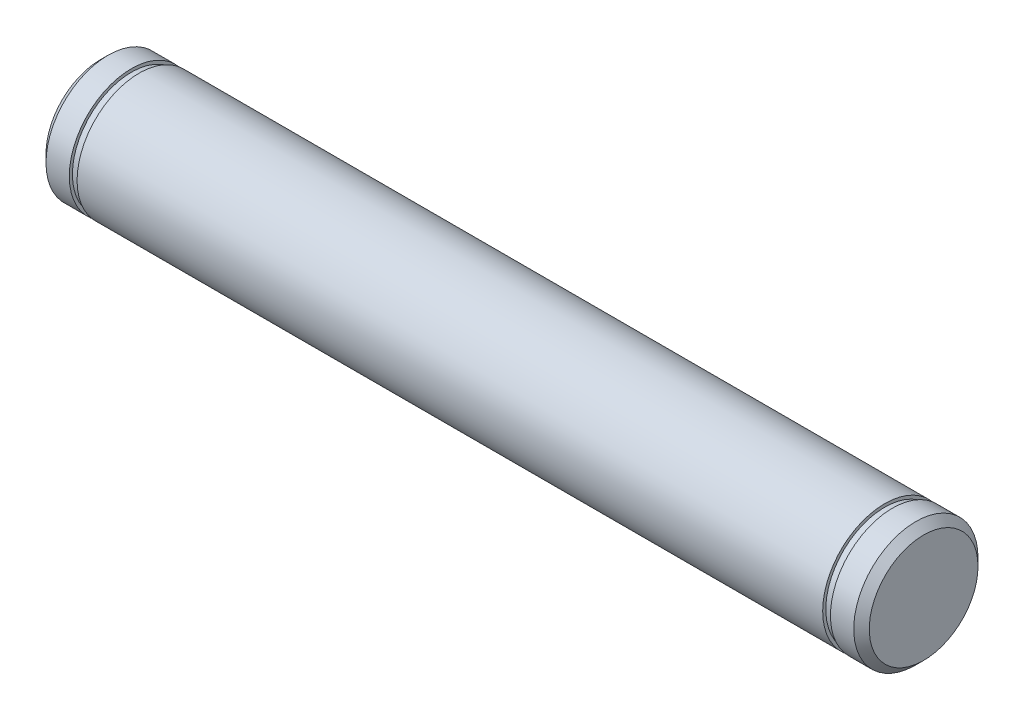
from build123d import *

# Parameters (mm, degrees)
SKETCH1_R           = 2
BOSS_EXTRUDE1_DEPTH = 26.5
CUT_EXTRUDE2_START  = -1
SKETCH2_R           = 2.498108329
SKETCH2_R_2         = 1.9
CUT_EXTRUDE2_DEPTH  = 0.25
CUT_EXTRUDE3_START  = -1.25
SKETCH3_R           = 2.5
SKETCH3_R_2         = 1.9
CUT_EXTRUDE3_DEPTH  = 0.25
CHAMFER1_SIZE       = 0.25


with BuildPart() as part:
    # Sketch1 → Boss-Extrude1 (new body)
    with BuildSketch(Plane(origin=(0, 0, 0), x_dir=(0, 0, -1), z_dir=(1, 0, 0))):
        Circle(SKETCH1_R)
    extrude(amount=BOSS_EXTRUDE1_DEPTH)

    # Sketch2 → Cut-Extrude2 (cut)
    with BuildSketch(Plane(origin=(26.5, 0, 0), x_dir=(0, 0, -1), z_dir=(1, 0, 0)).offset(CUT_EXTRUDE2_START)):
        Circle(SKETCH2_R)
        Circle(SKETCH2_R_2, mode=Mode.SUBTRACT)
    extrude(amount=-CUT_EXTRUDE2_DEPTH, mode=Mode.SUBTRACT)

    # Sketch3 → Cut-Extrude3 (cut)
    with BuildSketch(Plane.ZY.offset(CUT_EXTRUDE3_START)):
        Circle(SKETCH3_R)
        with Locations(Location((0, 0, 0), (0, 0, 180))):
            Circle(SKETCH3_R_2, mode=Mode.SUBTRACT)
    extrude(amount=CUT_EXTRUDE3_DEPTH, mode=Mode.SUBTRACT)

    # Chamfer1
    chamfer1_edges = [part.edges().sort_by_distance(p)[0] for p in [
        (0, 0, 2),
        (26.5, 0, 2),
    ]]
    chamfer(chamfer1_edges, length=CHAMFER1_SIZE)


solid = part.part
